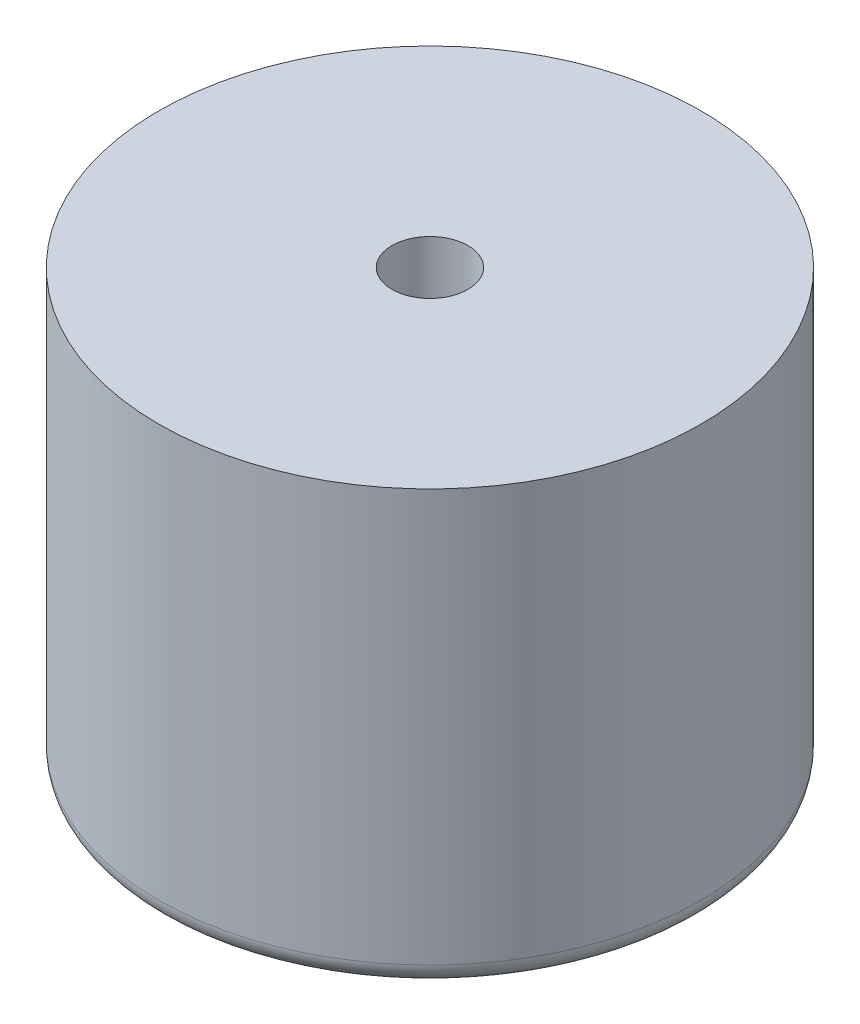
ISO-10303-21;
HEADER;
FILE_DESCRIPTION(('STEP AP214'),'2;1');
FILE_NAME('part.step','',(''),(''),'','','');
FILE_SCHEMA(('AUTOMOTIVE_DESIGN { 1 0 10303 214 1 1 1 1 }'));
ENDSEC;
DATA;
#1=APPLICATION_CONTEXT('core data for automotive mechanical design processes');
#2=APPLICATION_PROTOCOL_DEFINITION('international standard','automotive_design',2000,#1);
#3=PRODUCT_CONTEXT('',#1,'mechanical');
#4=PRODUCT('Part','Part','',(#3));
#5=PRODUCT_RELATED_PRODUCT_CATEGORY('part','',(#4));
#6=PRODUCT_DEFINITION_FORMATION('','',#4);
#7=PRODUCT_DEFINITION_CONTEXT('part definition',#1,'design');
#8=PRODUCT_DEFINITION('design','',#6,#7);
#9=PRODUCT_DEFINITION_SHAPE('','',#8);
#10=(LENGTH_UNIT() NAMED_UNIT(*) SI_UNIT(.MILLI.,.METRE.));
#11=(NAMED_UNIT(*) PLANE_ANGLE_UNIT() SI_UNIT($,.RADIAN.));
#12=(NAMED_UNIT(*) SI_UNIT($,.STERADIAN.) SOLID_ANGLE_UNIT());
#13=UNCERTAINTY_MEASURE_WITH_UNIT(LENGTH_MEASURE(1.E-05),#10,'distance_accuracy_value','');
#14=(GEOMETRIC_REPRESENTATION_CONTEXT(3) GLOBAL_UNCERTAINTY_ASSIGNED_CONTEXT((#13)) GLOBAL_UNIT_ASSIGNED_CONTEXT((#10,
#11,#12)) REPRESENTATION_CONTEXT('',''));
#15=CARTESIAN_POINT('',(0.,0.,0.));
#16=DIRECTION('',(0.,0.,1.));
#17=DIRECTION('',(1.,0.,0.));
#18=AXIS2_PLACEMENT_3D('',#15,#16,#17);
#19=CARTESIAN_POINT('',(0.,40.,0.));
#20=DIRECTION('',(0.,-1.,0.));
#21=DIRECTION('',(0.,0.,-1.));
#22=AXIS2_PLACEMENT_3D('',#19,#20,#21);
#23=CYLINDRICAL_SURFACE('',#22,25.);
#24=CARTESIAN_POINT('',(0.,2.,0.));
#25=DIRECTION('',(0.,1.,0.));
#26=DIRECTION('',(0.,0.,1.));
#27=AXIS2_PLACEMENT_3D('',#24,#25,#26);
#28=CIRCLE('',#27,25.);
#29=CARTESIAN_POINT('',(0.,2.,25.));
#30=VERTEX_POINT('',#29);
#31=EDGE_CURVE('E42',#30,#30,#28,.T.);
#32=ORIENTED_EDGE('',*,*,#31,.T.);
#33=EDGE_LOOP('',(#32));
#34=FACE_BOUND('',#33,.T.);
#35=CARTESIAN_POINT('',(0.,40.,0.));
#36=DIRECTION('',(0.,1.,0.));
#37=DIRECTION('',(0.,0.,1.));
#38=AXIS2_PLACEMENT_3D('',#35,#36,#37);
#39=CIRCLE('',#38,25.);
#40=CARTESIAN_POINT('',(0.,40.,25.));
#41=VERTEX_POINT('',#40);
#42=EDGE_CURVE('E49',#41,#41,#39,.T.);
#43=ORIENTED_EDGE('',*,*,#42,.F.);
#44=EDGE_LOOP('',(#43));
#45=FACE_BOUND('',#44,.T.);
#46=ADVANCED_FACE('F34',(#34,#45),#23,.T.);
#47=CARTESIAN_POINT('',(0.,40.,0.));
#48=DIRECTION('',(0.,1.,0.));
#49=DIRECTION('',(0.,0.,1.));
#50=AXIS2_PLACEMENT_3D('',#47,#48,#49);
#51=PLANE('',#50);
#52=CARTESIAN_POINT('',(0.,40.,0.));
#53=DIRECTION('',(0.,-1.,0.));
#54=DIRECTION('',(0.,0.,-1.));
#55=AXIS2_PLACEMENT_3D('',#52,#53,#54);
#56=CIRCLE('',#55,3.49999999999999);
#57=CARTESIAN_POINT('',(0.,40.,-3.49999999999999));
#58=VERTEX_POINT('',#57);
#59=EDGE_CURVE('E53',#58,#58,#56,.T.);
#60=ORIENTED_EDGE('',*,*,#59,.T.);
#61=EDGE_LOOP('',(#60));
#62=FACE_BOUND('',#61,.T.);
#63=ORIENTED_EDGE('',*,*,#42,.T.);
#64=EDGE_LOOP('',(#63));
#65=FACE_BOUND('',#64,.T.);
#66=ADVANCED_FACE('F73',(#62,#65),#51,.T.);
#67=CARTESIAN_POINT('',(0.,0.,0.));
#68=DIRECTION('',(0.,1.,0.));
#69=DIRECTION('',(0.,0.,1.));
#70=AXIS2_PLACEMENT_3D('',#67,#68,#69);
#71=PLANE('',#70);
#72=CARTESIAN_POINT('',(0.,0.,0.));
#73=DIRECTION('',(0.,-1.,0.));
#74=DIRECTION('',(0.,0.,-1.));
#75=AXIS2_PLACEMENT_3D('',#72,#73,#74);
#76=CIRCLE('',#75,8.5);
#77=CARTESIAN_POINT('',(0.,0.,-8.5));
#78=VERTEX_POINT('',#77);
#79=EDGE_CURVE('E63',#78,#78,#76,.T.);
#80=ORIENTED_EDGE('',*,*,#79,.F.);
#81=EDGE_LOOP('',(#80));
#82=FACE_BOUND('',#81,.T.);
#83=CARTESIAN_POINT('',(0.,0.,0.));
#84=DIRECTION('',(0.,1.,0.));
#85=DIRECTION('',(0.,0.,1.));
#86=AXIS2_PLACEMENT_3D('',#83,#84,#85);
#87=CIRCLE('',#86,23.);
#88=CARTESIAN_POINT('',(0.,0.,23.));
#89=VERTEX_POINT('',#88);
#90=EDGE_CURVE('E10',#89,#89,#87,.F.);
#91=ORIENTED_EDGE('',*,*,#90,.T.);
#92=EDGE_LOOP('',(#91));
#93=FACE_BOUND('',#92,.T.);
#94=ADVANCED_FACE('F71',(#82,#93),#71,.F.);
#95=CARTESIAN_POINT('',(0.,2.,0.));
#96=DIRECTION('',(0.,1.,0.));
#97=DIRECTION('',(0.,0.,1.));
#98=AXIS2_PLACEMENT_3D('',#95,#96,#97);
#99=TOROIDAL_SURFACE('',#98,23.,2.);
#100=ORIENTED_EDGE('',*,*,#90,.F.);
#101=EDGE_LOOP('',(#100));
#102=FACE_BOUND('',#101,.T.);
#103=ORIENTED_EDGE('',*,*,#31,.F.);
#104=EDGE_LOOP('',(#103));
#105=FACE_BOUND('',#104,.T.);
#106=ADVANCED_FACE('F36',(#102,#105),#99,.T.);
#107=CARTESIAN_POINT('',(0.,0.,0.));
#108=DIRECTION('',(0.,-1.,0.));
#109=DIRECTION('',(0.,0.,-1.));
#110=AXIS2_PLACEMENT_3D('',#107,#108,#109);
#111=CYLINDRICAL_SURFACE('',#110,3.5);
#112=ORIENTED_EDGE('',*,*,#59,.F.);
#113=EDGE_LOOP('',(#112));
#114=FACE_BOUND('',#113,.T.);
#115=CARTESIAN_POINT('',(0.,5.,0.));
#116=DIRECTION('',(0.,-1.,0.));
#117=DIRECTION('',(0.,0.,-1.));
#118=AXIS2_PLACEMENT_3D('',#115,#116,#117);
#119=CIRCLE('',#118,3.5);
#120=CARTESIAN_POINT('',(0.,5.,-3.5));
#121=VERTEX_POINT('',#120);
#122=EDGE_CURVE('E59',#121,#121,#119,.T.);
#123=ORIENTED_EDGE('',*,*,#122,.T.);
#124=EDGE_LOOP('',(#123));
#125=FACE_BOUND('',#124,.T.);
#126=ADVANCED_FACE('F78',(#114,#125),#111,.F.);
#127=CARTESIAN_POINT('',(0.,0.,0.));
#128=DIRECTION('',(0.,-1.,0.));
#129=DIRECTION('',(0.,0.,-1.));
#130=AXIS2_PLACEMENT_3D('',#127,#128,#129);
#131=CONICAL_SURFACE('',#130,8.5,0.785398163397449);
#132=ORIENTED_EDGE('',*,*,#122,.F.);
#133=EDGE_LOOP('',(#132));
#134=FACE_BOUND('',#133,.T.);
#135=ORIENTED_EDGE('',*,*,#79,.T.);
#136=EDGE_LOOP('',(#135));
#137=FACE_BOUND('',#136,.T.);
#138=ADVANCED_FACE('F69',(#134,#137),#131,.F.);
#139=CLOSED_SHELL('',(#46,#66,#94,#106,#126,#138));
#140=MANIFOLD_SOLID_BREP('B2',#139);
#141=ADVANCED_BREP_SHAPE_REPRESENTATION('',(#18,#140),#14);
#142=SHAPE_DEFINITION_REPRESENTATION(#9,#141);
ENDSEC;
END-ISO-10303-21;
